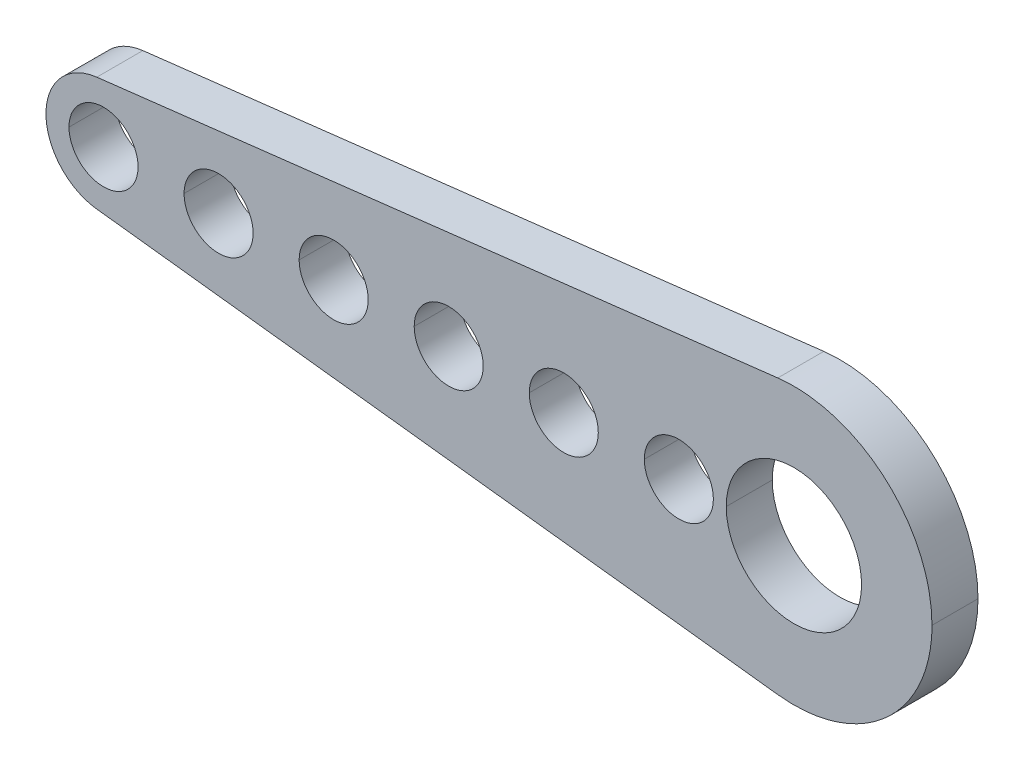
ISO-10303-21;
HEADER;
FILE_DESCRIPTION(('STEP AP214'),'2;1');
FILE_NAME('part.step','',(''),(''),'','','');
FILE_SCHEMA(('AUTOMOTIVE_DESIGN { 1 0 10303 214 1 1 1 1 }'));
ENDSEC;
DATA;
#1=APPLICATION_CONTEXT('core data for automotive mechanical design processes');
#2=APPLICATION_PROTOCOL_DEFINITION('international standard','automotive_design',2000,#1);
#3=PRODUCT_CONTEXT('',#1,'mechanical');
#4=PRODUCT('Part','Part','',(#3));
#5=PRODUCT_RELATED_PRODUCT_CATEGORY('part','',(#4));
#6=PRODUCT_DEFINITION_FORMATION('','',#4);
#7=PRODUCT_DEFINITION_CONTEXT('part definition',#1,'design');
#8=PRODUCT_DEFINITION('design','',#6,#7);
#9=PRODUCT_DEFINITION_SHAPE('','',#8);
#10=(LENGTH_UNIT() NAMED_UNIT(*) SI_UNIT(.MILLI.,.METRE.));
#11=(NAMED_UNIT(*) PLANE_ANGLE_UNIT() SI_UNIT($,.RADIAN.));
#12=(NAMED_UNIT(*) SI_UNIT($,.STERADIAN.) SOLID_ANGLE_UNIT());
#13=UNCERTAINTY_MEASURE_WITH_UNIT(LENGTH_MEASURE(1.E-05),#10,'distance_accuracy_value','');
#14=(GEOMETRIC_REPRESENTATION_CONTEXT(3) GLOBAL_UNCERTAINTY_ASSIGNED_CONTEXT((#13)) GLOBAL_UNIT_ASSIGNED_CONTEXT((#10,
#11,#12)) REPRESENTATION_CONTEXT('',''));
#15=CARTESIAN_POINT('',(0.,0.,0.));
#16=DIRECTION('',(0.,0.,1.));
#17=DIRECTION('',(1.,0.,0.));
#18=AXIS2_PLACEMENT_3D('',#15,#16,#17);
#19=CARTESIAN_POINT('',(-4.46921935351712,-6.01374839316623,2.));
#20=DIRECTION('',(0.,0.,1.));
#21=DIRECTION('',(1.,0.,0.));
#22=AXIS2_PLACEMENT_3D('',#19,#20,#21);
#23=PLANE('',#22);
#24=CARTESIAN_POINT('',(27.5213652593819,-5.95902676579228,2.));
#25=CARTESIAN_POINT('',(27.9875457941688,-6.01374839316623,2.));
#26=CARTESIAN_POINT('',(28.4584197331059,-6.01366200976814,2.));
#27=CARTESIAN_POINT('',(29.3980855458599,-5.90277662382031,2.));
#28=CARTESIAN_POINT('',(29.8538284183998,-5.79225514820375,2.));
#29=CARTESIAN_POINT('',(30.6136306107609,-5.51326479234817,2.));
#30=CARTESIAN_POINT('',(30.9270544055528,-5.36639644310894,2.));
#31=CARTESIAN_POINT('',(31.6069806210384,-4.97302191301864,2.));
#32=CARTESIAN_POINT('',(31.9624855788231,-4.71142630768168,2.));
#33=CARTESIAN_POINT('',(33.0010973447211,-3.75484068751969,2.));
#34=CARTESIAN_POINT('',(33.5456260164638,-2.93203369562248,2.));
#35=CARTESIAN_POINT('',(34.1075094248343,-1.35737417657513,2.));
#36=CARTESIAN_POINT('',(34.2216055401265,-0.675608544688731,2.));
#37=CARTESIAN_POINT('',(34.2214754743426,2.13658795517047E-08,2.));
#38=B_SPLINE_CURVE_WITH_KNOTS('',3,(#24,#25,#26,#27,#28,#29,#30,#31,#32,#33,#34,#35,#36,#37),
.UNSPECIFIED.,.F.,.F.,(4,2,2,2,2,2,4),(0.,0.135206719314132,0.272542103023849,0.374811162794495,
0.505077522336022,0.792809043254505,1.),.UNSPECIFIED.);
#39=CARTESIAN_POINT('',(27.5213652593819,-5.95902676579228,2.));
#40=VERTEX_POINT('',#39);
#41=CARTESIAN_POINT('',(34.2214754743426,2.13658878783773E-08,2.));
#42=VERTEX_POINT('',#41);
#43=EDGE_CURVE('E11',#40,#42,#38,.T.);
#44=ORIENTED_EDGE('',*,*,#43,.T.);
#45=CARTESIAN_POINT('',(34.2214754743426,2.13658795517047E-08,2.));
#46=CARTESIAN_POINT('',(34.2212151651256,1.62354944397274,2.));
#47=CARTESIAN_POINT('',(33.5613147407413,3.21154273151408,2.));
#48=CARTESIAN_POINT('',(31.9166063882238,4.76232973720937,2.));
#49=CARTESIAN_POINT('',(31.4374694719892,5.10010105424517,2.));
#50=CARTESIAN_POINT('',(30.556651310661,5.54053892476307,2.));
#51=CARTESIAN_POINT('',(30.1924402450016,5.68033011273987,2.));
#52=CARTESIAN_POINT('',(29.3859744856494,5.90287682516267,2.));
#53=CARTESIAN_POINT('',(28.9427549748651,5.97326367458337,2.));
#54=CARTESIAN_POINT('',(28.1705592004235,6.00859958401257,2.));
#55=CARTESIAN_POINT('',(27.8447063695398,5.99698148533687,2.));
#56=CARTESIAN_POINT('',(27.5213652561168,5.95902676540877,2.));
#57=B_SPLINE_CURVE_WITH_KNOTS('',3,(#45,#46,#47,#48,#49,#50,#51,#52,#53,#54,#55,#56),
.UNSPECIFIED.,.F.,.F.,(4,2,2,2,2,4),(0.,0.496258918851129,0.66694679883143,0.77847825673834,
0.906698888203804,1.),.UNSPECIFIED.);
#58=CARTESIAN_POINT('',(27.5213652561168,5.95902676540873,2.));
#59=VERTEX_POINT('',#58);
#60=EDGE_CURVE('E24',#42,#59,#57,.T.);
#61=ORIENTED_EDGE('',*,*,#60,.T.);
#62=CARTESIAN_POINT('',(27.5213652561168,5.95902676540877,2.));
#63=CARTESIAN_POINT('',(17.6574566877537,4.80034291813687,2.));
#64=CARTESIAN_POINT('',(7.79354811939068,3.64165907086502,2.));
#65=CARTESIAN_POINT('',(-2.07028754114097,2.48291133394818,2.));
#66=CARTESIAN_POINT('',(-2.07029342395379,2.48291064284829,2.));
#67=CARTESIAN_POINT('',(-2.07029930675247,2.48290995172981,2.));
#68=B_SPLINE_CURVE_WITH_KNOTS('',3,(#62,#63,#64,#65,#66,#67),.UNSPECIFIED.,.F.,.F.,(4,2,4),(0.,
0.999999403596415,1.),.UNSPECIFIED.);
#69=CARTESIAN_POINT('',(-2.07029930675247,2.48290995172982,2.));
#70=VERTEX_POINT('',#69);
#71=EDGE_CURVE('E433',#59,#70,#68,.T.);
#72=ORIENTED_EDGE('',*,*,#71,.T.);
#73=CARTESIAN_POINT('',(-2.07029930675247,2.48290995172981,2.));
#74=CARTESIAN_POINT('',(-2.3269335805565,2.45275307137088,2.));
#75=CARTESIAN_POINT('',(-2.55667440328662,2.38722255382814,2.));
#76=CARTESIAN_POINT('',(-3.0544967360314,2.17223776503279,2.));
#77=CARTESIAN_POINT('',(-3.29190454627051,2.00948053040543,2.));
#78=CARTESIAN_POINT('',(-4.22007546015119,1.133096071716,2.));
#79=CARTESIAN_POINT('',(-4.46921935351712,0.0828680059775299,2.));
#80=CARTESIAN_POINT('',(-4.0222755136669,-1.14533912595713,2.));
#81=CARTESIAN_POINT('',(-3.86348658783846,-1.41381135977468,2.));
#82=CARTESIAN_POINT('',(-3.52458046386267,-1.80103740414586,2.));
#83=CARTESIAN_POINT('',(-3.37081645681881,-1.93833629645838,2.));
#84=CARTESIAN_POINT('',(-3.01422242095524,-2.18534453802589,2.));
#85=CARTESIAN_POINT('',(-2.80629366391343,-2.29243787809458,2.));
#86=CARTESIAN_POINT('',(-2.40891945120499,-2.42534393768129,2.));
#87=CARTESIAN_POINT('',(-2.24090518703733,-2.46286998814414,2.));
#88=CARTESIAN_POINT('',(-2.07029999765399,-2.48291583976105,2.));
#89=B_SPLINE_CURVE_WITH_KNOTS('',3,(#73,#74,#75,#76,#77,#78,#79,#80,#81,#82,#83,#84,#85,#86,#87,
#88),.UNSPECIFIED.,.F.,.F.,(4,2,2,2,2,2,2,4),(0.,0.087594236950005,0.204501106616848,
0.622371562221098,0.751872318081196,0.837869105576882,0.93353580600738,1.),.UNSPECIFIED.);
#90=CARTESIAN_POINT('',(-2.07029999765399,-2.48291583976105,2.));
#91=VERTEX_POINT('',#90);
#92=EDGE_CURVE('E821',#70,#91,#89,.T.);
#93=ORIENTED_EDGE('',*,*,#92,.T.);
#94=CARTESIAN_POINT('',(-2.07029999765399,-2.48291583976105,2.));
#95=CARTESIAN_POINT('',(-2.0702960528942,-2.48291630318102,2.));
#96=CARTESIAN_POINT('',(-2.07029210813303,-2.48291676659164,2.));
#97=CARTESIAN_POINT('',(7.79356109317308,-3.64164865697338,2.));
#98=CARTESIAN_POINT('',(17.6574631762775,-4.80033771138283,2.));
#99=CARTESIAN_POINT('',(27.5213652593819,-5.95902676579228,2.));
#100=B_SPLINE_CURVE_WITH_KNOTS('',3,(#94,#95,#96,#97,#98,#99),.UNSPECIFIED.,.F.,.F.,(4,2,4),(0.,
3.99921053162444E-07,1.),.UNSPECIFIED.);
#101=EDGE_CURVE('E781',#91,#40,#100,.T.);
#102=ORIENTED_EDGE('',*,*,#101,.T.);
#103=EDGE_LOOP('',(#44,#61,#72,#93,#102));
#104=FACE_BOUND('',#103,.T.);
#105=CARTESIAN_POINT('',(28.221365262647,0.,2.));
#106=DIRECTION('',(0.,0.,1.));
#107=DIRECTION('',(-1.,0.,0.));
#108=AXIS2_PLACEMENT_3D('',#105,#106,#107);
#109=CIRCLE('',#108,2.94);
#110=CARTESIAN_POINT('',(25.281365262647,0.,2.));
#111=VERTEX_POINT('',#110);
#112=CARTESIAN_POINT('',(31.161365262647,0.,2.));
#113=VERTEX_POINT('',#112);
#114=EDGE_CURVE('E824',#111,#113,#109,.T.);
#115=ORIENTED_EDGE('',*,*,#114,.F.);
#116=CARTESIAN_POINT('',(28.221365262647,0.,2.));
#117=DIRECTION('',(0.,0.,1.));
#118=DIRECTION('',(1.,0.,0.));
#119=AXIS2_PLACEMENT_3D('',#116,#117,#118);
#120=CIRCLE('',#119,2.94);
#121=EDGE_CURVE('E827',#113,#111,#120,.T.);
#122=ORIENTED_EDGE('',*,*,#121,.F.);
#123=EDGE_LOOP('',(#115,#122));
#124=FACE_BOUND('',#123,.T.);
#125=CARTESIAN_POINT('',(18.221365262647,0.,2.));
#126=DIRECTION('',(0.,0.,1.));
#127=DIRECTION('',(-1.,0.,0.));
#128=AXIS2_PLACEMENT_3D('',#125,#126,#127);
#129=CIRCLE('',#128,1.5);
#130=CARTESIAN_POINT('',(16.721365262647,0.,2.));
#131=VERTEX_POINT('',#130);
#132=CARTESIAN_POINT('',(19.721365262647,0.,2.));
#133=VERTEX_POINT('',#132);
#134=EDGE_CURVE('E161',#131,#133,#129,.T.);
#135=ORIENTED_EDGE('',*,*,#134,.F.);
#136=CARTESIAN_POINT('',(18.221365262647,0.,2.));
#137=DIRECTION('',(0.,0.,1.));
#138=DIRECTION('',(1.,0.,0.));
#139=AXIS2_PLACEMENT_3D('',#136,#137,#138);
#140=CIRCLE('',#139,1.5);
#141=EDGE_CURVE('E716',#133,#131,#140,.T.);
#142=ORIENTED_EDGE('',*,*,#141,.F.);
#143=EDGE_LOOP('',(#135,#142));
#144=FACE_BOUND('',#143,.T.);
#145=CARTESIAN_POINT('',(23.221365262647,0.,2.));
#146=DIRECTION('',(0.,0.,1.));
#147=DIRECTION('',(-1.,0.,0.));
#148=AXIS2_PLACEMENT_3D('',#145,#146,#147);
#149=CIRCLE('',#148,1.5);
#150=CARTESIAN_POINT('',(21.721365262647,0.,2.));
#151=VERTEX_POINT('',#150);
#152=CARTESIAN_POINT('',(24.721365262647,0.,2.));
#153=VERTEX_POINT('',#152);
#154=EDGE_CURVE('E699',#151,#153,#149,.T.);
#155=ORIENTED_EDGE('',*,*,#154,.F.);
#156=CARTESIAN_POINT('',(23.221365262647,0.,2.));
#157=DIRECTION('',(0.,0.,1.));
#158=DIRECTION('',(1.,0.,0.));
#159=AXIS2_PLACEMENT_3D('',#156,#157,#158);
#160=CIRCLE('',#159,1.5);
#161=EDGE_CURVE('E550',#153,#151,#160,.T.);
#162=ORIENTED_EDGE('',*,*,#161,.F.);
#163=EDGE_LOOP('',(#155,#162));
#164=FACE_BOUND('',#163,.T.);
#165=CARTESIAN_POINT('',(13.221365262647,0.,2.));
#166=DIRECTION('',(0.,0.,1.));
#167=DIRECTION('',(-1.,0.,0.));
#168=AXIS2_PLACEMENT_3D('',#165,#166,#167);
#169=CIRCLE('',#168,1.5);
#170=CARTESIAN_POINT('',(11.721365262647,0.,2.));
#171=VERTEX_POINT('',#170);
#172=CARTESIAN_POINT('',(14.721365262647,0.,2.));
#173=VERTEX_POINT('',#172);
#174=EDGE_CURVE('E236',#171,#173,#169,.T.);
#175=ORIENTED_EDGE('',*,*,#174,.F.);
#176=CARTESIAN_POINT('',(13.221365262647,0.,2.));
#177=DIRECTION('',(0.,0.,1.));
#178=DIRECTION('',(1.,0.,0.));
#179=AXIS2_PLACEMENT_3D('',#176,#177,#178);
#180=CIRCLE('',#179,1.5);
#181=EDGE_CURVE('E259',#173,#171,#180,.T.);
#182=ORIENTED_EDGE('',*,*,#181,.F.);
#183=EDGE_LOOP('',(#175,#182));
#184=FACE_BOUND('',#183,.T.);
#185=CARTESIAN_POINT('',(-1.77863473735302,0.,2.));
#186=DIRECTION('',(0.,0.,1.));
#187=DIRECTION('',(-1.,0.,0.));
#188=AXIS2_PLACEMENT_3D('',#185,#186,#187);
#189=CIRCLE('',#188,1.5);
#190=CARTESIAN_POINT('',(-3.27863473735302,0.,2.));
#191=VERTEX_POINT('',#190);
#192=CARTESIAN_POINT('',(-0.278634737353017,0.,2.));
#193=VERTEX_POINT('',#192);
#194=EDGE_CURVE('E717',#191,#193,#189,.T.);
#195=ORIENTED_EDGE('',*,*,#194,.F.);
#196=CARTESIAN_POINT('',(-1.77863473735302,0.,2.));
#197=DIRECTION('',(0.,0.,1.));
#198=DIRECTION('',(1.,0.,0.));
#199=AXIS2_PLACEMENT_3D('',#196,#197,#198);
#200=CIRCLE('',#199,1.5);
#201=EDGE_CURVE('E719',#193,#191,#200,.T.);
#202=ORIENTED_EDGE('',*,*,#201,.F.);
#203=EDGE_LOOP('',(#195,#202));
#204=FACE_BOUND('',#203,.T.);
#205=CARTESIAN_POINT('',(3.22136526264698,0.,2.));
#206=DIRECTION('',(0.,0.,1.));
#207=DIRECTION('',(-1.,0.,0.));
#208=AXIS2_PLACEMENT_3D('',#205,#206,#207);
#209=CIRCLE('',#208,1.5);
#210=CARTESIAN_POINT('',(1.72136526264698,0.,2.));
#211=VERTEX_POINT('',#210);
#212=CARTESIAN_POINT('',(4.72136526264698,0.,2.));
#213=VERTEX_POINT('',#212);
#214=EDGE_CURVE('E617',#211,#213,#209,.T.);
#215=ORIENTED_EDGE('',*,*,#214,.F.);
#216=CARTESIAN_POINT('',(3.22136526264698,0.,2.));
#217=DIRECTION('',(0.,0.,1.));
#218=DIRECTION('',(1.,0.,0.));
#219=AXIS2_PLACEMENT_3D('',#216,#217,#218);
#220=CIRCLE('',#219,1.5);
#221=EDGE_CURVE('E636',#213,#211,#220,.T.);
#222=ORIENTED_EDGE('',*,*,#221,.F.);
#223=EDGE_LOOP('',(#215,#222));
#224=FACE_BOUND('',#223,.T.);
#225=CARTESIAN_POINT('',(8.22136526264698,0.,2.));
#226=DIRECTION('',(0.,0.,1.));
#227=DIRECTION('',(-1.,0.,0.));
#228=AXIS2_PLACEMENT_3D('',#225,#226,#227);
#229=CIRCLE('',#228,1.5);
#230=CARTESIAN_POINT('',(6.72136526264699,0.,2.));
#231=VERTEX_POINT('',#230);
#232=CARTESIAN_POINT('',(9.72136526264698,0.,2.));
#233=VERTEX_POINT('',#232);
#234=EDGE_CURVE('E723',#231,#233,#229,.T.);
#235=ORIENTED_EDGE('',*,*,#234,.F.);
#236=CARTESIAN_POINT('',(8.22136526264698,0.,2.));
#237=DIRECTION('',(0.,0.,1.));
#238=DIRECTION('',(1.,0.,0.));
#239=AXIS2_PLACEMENT_3D('',#236,#237,#238);
#240=CIRCLE('',#239,1.5);
#241=EDGE_CURVE('E725',#233,#231,#240,.T.);
#242=ORIENTED_EDGE('',*,*,#241,.F.);
#243=EDGE_LOOP('',(#235,#242));
#244=FACE_BOUND('',#243,.T.);
#245=ADVANCED_FACE('F16',(#104,#124,#144,#164,#184,#204,#224,#244),#23,.T.);
#246=CARTESIAN_POINT('',(8.22136526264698,0.,2.));
#247=DIRECTION('',(0.,0.,-1.));
#248=DIRECTION('',(0.,-1.,0.));
#249=AXIS2_PLACEMENT_3D('',#246,#247,#248);
#250=CYLINDRICAL_SURFACE('',#249,1.5);
#251=ORIENTED_EDGE('',*,*,#241,.T.);
#252=CARTESIAN_POINT('',(6.72136526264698,0.,2.));
#253=DIRECTION('',(0.,0.,-1.));
#254=VECTOR('',#253,1.);
#255=LINE('',#252,#254);
#256=CARTESIAN_POINT('',(6.72136526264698,0.,0.));
#257=VERTEX_POINT('',#256);
#258=EDGE_CURVE('E731',#231,#257,#255,.T.);
#259=ORIENTED_EDGE('',*,*,#258,.T.);
#260=CARTESIAN_POINT('',(9.72136526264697,0.,0.));
#261=CARTESIAN_POINT('',(9.72125424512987,0.2732497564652,0.));
#262=CARTESIAN_POINT('',(9.64691567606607,0.540908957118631,0.));
#263=CARTESIAN_POINT('',(9.42691293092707,0.90545218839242,0.));
#264=CARTESIAN_POINT('',(9.32864629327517,1.0232538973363,0.));
#265=CARTESIAN_POINT('',(9.09107382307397,1.23311381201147,0.));
#266=CARTESIAN_POINT('',(8.94818428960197,1.32508314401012,0.));
#267=CARTESIAN_POINT('',(8.66624605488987,1.43748704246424,0.));
#268=CARTESIAN_POINT('',(8.54963354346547,1.46897668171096,0.));
#269=CARTESIAN_POINT('',(8.31738859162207,1.50095289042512,0.));
#270=CARTESIAN_POINT('',(8.20715344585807,1.5039434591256,0.));
#271=CARTESIAN_POINT('',(7.92798663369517,1.48088843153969,0.));
#272=CARTESIAN_POINT('',(7.77787628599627,1.44087189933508,0.));
#273=CARTESIAN_POINT('',(7.44941144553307,1.30250182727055,0.));
#274=CARTESIAN_POINT('',(7.29694924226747,1.19485291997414,0.));
#275=CARTESIAN_POINT('',(6.87914333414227,0.783351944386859,0.));
#276=CARTESIAN_POINT('',(6.72152726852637,0.39874848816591,0.));
#277=CARTESIAN_POINT('',(6.72136526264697,0.,0.));
#278=B_SPLINE_CURVE_WITH_KNOTS('',3,(#260,#261,#262,#263,#264,#265,#266,#267,#268,#269,#270,
#271,#272,#273,#274,#275,#276,#277),.UNSPECIFIED.,.F.,.F.,(4,2,2,2,2,2,2,2,4),(0.,
0.172881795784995,0.26935340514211,0.373407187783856,0.440456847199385,0.499546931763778,
0.59116495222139,0.71654709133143,1.),.UNSPECIFIED.);
#279=CARTESIAN_POINT('',(9.72136526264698,0.,0.));
#280=VERTEX_POINT('',#279);
#281=EDGE_CURVE('E735',#280,#257,#278,.T.);
#282=ORIENTED_EDGE('',*,*,#281,.F.);
#283=CARTESIAN_POINT('',(9.72136526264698,0.,0.));
#284=DIRECTION('',(0.,0.,1.));
#285=VECTOR('',#284,1.);
#286=LINE('',#283,#285);
#287=EDGE_CURVE('E739',#280,#233,#286,.T.);
#288=ORIENTED_EDGE('',*,*,#287,.T.);
#289=EDGE_LOOP('',(#251,#259,#282,#288));
#290=FACE_BOUND('',#289,.T.);
#291=ADVANCED_FACE('F953',(#290),#250,.F.);
#292=CARTESIAN_POINT('',(8.22136526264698,0.,2.));
#293=DIRECTION('',(0.,0.,-1.));
#294=DIRECTION('',(0.,1.,0.));
#295=AXIS2_PLACEMENT_3D('',#292,#293,#294);
#296=CYLINDRICAL_SURFACE('',#295,1.5);
#297=CARTESIAN_POINT('',(6.72136526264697,0.,0.));
#298=CARTESIAN_POINT('',(6.72147628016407,-0.27324975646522,0.));
#299=CARTESIAN_POINT('',(6.79581484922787,-0.54090895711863,0.));
#300=CARTESIAN_POINT('',(7.01581759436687,-0.90545218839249,0.));
#301=CARTESIAN_POINT('',(7.11408423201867,-1.02325389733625,0.));
#302=CARTESIAN_POINT('',(7.35165670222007,-1.23311381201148,0.));
#303=CARTESIAN_POINT('',(7.49454623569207,-1.32508314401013,0.));
#304=CARTESIAN_POINT('',(7.77648447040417,-1.43748704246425,0.));
#305=CARTESIAN_POINT('',(7.89309698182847,-1.46897668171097,0.));
#306=CARTESIAN_POINT('',(8.12534193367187,-1.50095289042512,0.));
#307=CARTESIAN_POINT('',(8.23557707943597,-1.50394345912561,0.));
#308=CARTESIAN_POINT('',(8.51474389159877,-1.4808884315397,0.));
#309=CARTESIAN_POINT('',(8.66485423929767,-1.44087189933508,0.));
#310=CARTESIAN_POINT('',(8.99331907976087,-1.30250182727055,0.));
#311=CARTESIAN_POINT('',(9.14578128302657,-1.19485291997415,0.));
#312=CARTESIAN_POINT('',(9.56358719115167,-0.783351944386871,0.));
#313=CARTESIAN_POINT('',(9.72120325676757,-0.39874848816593,0.));
#314=CARTESIAN_POINT('',(9.72136526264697,0.,0.));
#315=B_SPLINE_CURVE_WITH_KNOTS('',3,(#297,#298,#299,#300,#301,#302,#303,#304,#305,#306,#307,
#308,#309,#310,#311,#312,#313,#314),.UNSPECIFIED.,.F.,.F.,(4,2,2,2,2,2,2,2,4),(0.,
0.172881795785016,0.269353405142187,0.373407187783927,0.440456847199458,0.499546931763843,
0.591164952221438,0.716547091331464,1.),.UNSPECIFIED.);
#316=EDGE_CURVE('E741',#257,#280,#315,.T.);
#317=ORIENTED_EDGE('',*,*,#316,.F.);
#318=ORIENTED_EDGE('',*,*,#258,.F.);
#319=ORIENTED_EDGE('',*,*,#234,.T.);
#320=ORIENTED_EDGE('',*,*,#287,.F.);
#321=EDGE_LOOP('',(#317,#318,#319,#320));
#322=FACE_BOUND('',#321,.T.);
#323=ADVANCED_FACE('F323',(#322),#296,.F.);
#324=CARTESIAN_POINT('',(-4.46921935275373,-6.00859958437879,0.));
#325=DIRECTION('',(0.,0.,-1.));
#326=DIRECTION('',(0.,1.,0.));
#327=AXIS2_PLACEMENT_3D('',#324,#325,#326);
#328=PLANE('',#327);
#329=CARTESIAN_POINT('',(-1.77863473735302,0.,0.));
#330=DIRECTION('',(0.,0.,1.));
#331=DIRECTION('',(-0.116666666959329,0.993171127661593,0.));
#332=AXIS2_PLACEMENT_3D('',#329,#330,#331);
#333=CIRCLE('',#332,2.5);
#334=CARTESIAN_POINT('',(-2.07029999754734,2.48291583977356,0.));
#335=VERTEX_POINT('',#334);
#336=CARTESIAN_POINT('',(-2.07029930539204,-2.48290995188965,0.));
#337=VERTEX_POINT('',#336);
#338=EDGE_CURVE('E424',#335,#337,#333,.T.);
#339=ORIENTED_EDGE('',*,*,#338,.F.);
#340=CARTESIAN_POINT('',(27.5213652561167,5.95902676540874,0.));
#341=DIRECTION('',(-0.993171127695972,-0.116666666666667,0.));
#342=VECTOR('',#341,1.);
#343=LINE('',#340,#342);
#344=CARTESIAN_POINT('',(27.5213652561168,5.95902676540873,0.));
#345=VERTEX_POINT('',#344);
#346=EDGE_CURVE('E420',#345,#335,#343,.T.);
#347=ORIENTED_EDGE('',*,*,#346,.F.);
#348=CARTESIAN_POINT('',(28.221365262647,0.,0.));
#349=DIRECTION('',(0.,0.,1.));
#350=DIRECTION('',(1.,-3.56092000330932E-09,0.));
#351=AXIS2_PLACEMENT_3D('',#348,#349,#350);
#352=CIRCLE('',#351,6.00000000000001);
#353=CARTESIAN_POINT('',(34.2214754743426,-2.13658844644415E-08,0.));
#354=VERTEX_POINT('',#353);
#355=EDGE_CURVE('E410',#354,#345,#352,.T.);
#356=ORIENTED_EDGE('',*,*,#355,.F.);
#357=CARTESIAN_POINT('',(28.221365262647,0.,0.));
#358=DIRECTION('',(0.,0.,1.));
#359=DIRECTION('',(-0.11666666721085,-0.993171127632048,0.));
#360=AXIS2_PLACEMENT_3D('',#357,#358,#359);
#361=CIRCLE('',#360,6.);
#362=CARTESIAN_POINT('',(27.5213652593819,-5.95902676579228,0.));
#363=VERTEX_POINT('',#362);
#364=EDGE_CURVE('E446',#363,#354,#361,.T.);
#365=ORIENTED_EDGE('',*,*,#364,.F.);
#366=CARTESIAN_POINT('',(-2.07030140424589,-2.48292781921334,0.));
#367=DIRECTION('',(0.993171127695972,-0.116666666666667,0.));
#368=VECTOR('',#367,1.);
#369=LINE('',#366,#368);
#370=EDGE_CURVE('E789',#337,#363,#369,.T.);
#371=ORIENTED_EDGE('',*,*,#370,.F.);
#372=EDGE_LOOP('',(#339,#347,#356,#365,#371));
#373=FACE_BOUND('',#372,.T.);
#374=CARTESIAN_POINT('',(31.161365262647,0.,0.));
#375=CARTESIAN_POINT('',(31.1611476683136,0.53556952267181,0.));
#376=CARTESIAN_POINT('',(31.0154440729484,1.06018155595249,0.));
#377=CARTESIAN_POINT('',(30.584238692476,1.77468628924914,0.));
#378=CARTESIAN_POINT('',(30.3916360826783,2.00557763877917,0.));
#379=CARTESIAN_POINT('',(30.0211796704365,2.33282073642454,0.));
#380=CARTESIAN_POINT('',(29.8622145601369,2.44727981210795,0.));
#381=CARTESIAN_POINT('',(29.4911881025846,2.66191718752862,0.));
#382=CARTESIAN_POINT('',(29.2738698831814,2.75605701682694,0.));
#383=CARTESIAN_POINT('',(28.7736255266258,2.90098699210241,0.));
#384=CARTESIAN_POINT('',(28.4982835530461,2.94,0.));
#385=CARTESIAN_POINT('',(27.9444469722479,2.93999999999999,0.));
#386=CARTESIAN_POINT('',(27.6691049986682,2.90098699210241,0.));
#387=CARTESIAN_POINT('',(27.1227200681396,2.74268924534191,0.));
#388=CARTESIAN_POINT('',(26.874941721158,2.62713603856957,0.));
#389=CARTESIAN_POINT('',(26.3004269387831,2.26363088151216,0.));
#390=CARTESIAN_POINT('',(26.0162501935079,1.98294329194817,0.));
#391=CARTESIAN_POINT('',(25.4605537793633,1.17227659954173,0.));
#392=CARTESIAN_POINT('',(25.2816064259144,0.59358023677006,0.));
#393=CARTESIAN_POINT('',(25.281365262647,0.,0.));
#394=B_SPLINE_CURVE_WITH_KNOTS('',3,(#374,#375,#376,#377,#378,#379,#380,#381,#382,#383,#384,
#385,#386,#387,#388,#389,#390,#391,#392,#393),.UNSPECIFIED.,.F.,.F.,(4,2,2,2,2,2,2,2,2,4),(0.,
0.169172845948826,0.263574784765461,0.325284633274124,0.398958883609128,0.482558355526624,
0.566157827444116,0.654338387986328,0.791216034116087,1.),.UNSPECIFIED.);
#395=CARTESIAN_POINT('',(31.161365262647,0.,0.));
#396=VERTEX_POINT('',#395);
#397=CARTESIAN_POINT('',(25.281365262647,0.,0.));
#398=VERTEX_POINT('',#397);
#399=EDGE_CURVE('E876',#396,#398,#394,.T.);
#400=ORIENTED_EDGE('',*,*,#399,.T.);
#401=CARTESIAN_POINT('',(25.281365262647,0.,0.));
#402=CARTESIAN_POINT('',(25.2815828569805,-0.53556952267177,0.));
#403=CARTESIAN_POINT('',(25.4272864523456,-1.06018155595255,0.));
#404=CARTESIAN_POINT('',(25.8584918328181,-1.77468628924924,0.));
#405=CARTESIAN_POINT('',(26.0510944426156,-2.00557763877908,0.));
#406=CARTESIAN_POINT('',(26.4215508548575,-2.33282073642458,0.));
#407=CARTESIAN_POINT('',(26.5805159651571,-2.44727981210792,0.));
#408=CARTESIAN_POINT('',(26.9515424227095,-2.66191718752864,0.));
#409=CARTESIAN_POINT('',(27.1688606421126,-2.75605701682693,0.));
#410=CARTESIAN_POINT('',(27.6691049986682,-2.90098699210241,0.));
#411=CARTESIAN_POINT('',(27.9444469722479,-2.94,0.));
#412=CARTESIAN_POINT('',(28.4982835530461,-2.94,0.));
#413=CARTESIAN_POINT('',(28.7736255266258,-2.90098699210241,0.));
#414=CARTESIAN_POINT('',(29.3200104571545,-2.74268924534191,0.));
#415=CARTESIAN_POINT('',(29.567788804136,-2.6271360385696,0.));
#416=CARTESIAN_POINT('',(30.1423035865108,-2.2636308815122,0.));
#417=CARTESIAN_POINT('',(30.4264803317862,-1.98294329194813,0.));
#418=CARTESIAN_POINT('',(30.9821767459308,-1.17227659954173,0.));
#419=CARTESIAN_POINT('',(31.1611240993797,-0.593580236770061,0.));
#420=CARTESIAN_POINT('',(31.161365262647,0.,0.));
#421=B_SPLINE_CURVE_WITH_KNOTS('',3,(#401,#402,#403,#404,#405,#406,#407,#408,#409,#410,#411,
#412,#413,#414,#415,#416,#417,#418,#419,#420),.UNSPECIFIED.,.F.,.F.,(4,2,2,2,2,2,2,2,2,4),(0.,
0.169172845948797,0.263574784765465,0.325284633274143,0.39895888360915,0.482558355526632,
0.566157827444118,0.654338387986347,0.791216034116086,1.),.UNSPECIFIED.);
#422=EDGE_CURVE('E875',#398,#396,#421,.T.);
#423=ORIENTED_EDGE('',*,*,#422,.T.);
#424=EDGE_LOOP('',(#400,#423));
#425=FACE_BOUND('',#424,.T.);
#426=CARTESIAN_POINT('',(-0.27863473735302,0.,0.));
#427=CARTESIAN_POINT('',(-0.27874575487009,0.2732497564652,0.));
#428=CARTESIAN_POINT('',(-0.35308432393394,0.540908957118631,0.));
#429=CARTESIAN_POINT('',(-0.573087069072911,0.90545218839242,0.));
#430=CARTESIAN_POINT('',(-0.671353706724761,1.02325389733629,0.));
#431=CARTESIAN_POINT('',(-0.908926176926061,1.23311381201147,0.));
#432=CARTESIAN_POINT('',(-1.05181571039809,1.32508314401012,0.));
#433=CARTESIAN_POINT('',(-1.33375394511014,1.43748704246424,0.));
#434=CARTESIAN_POINT('',(-1.45036645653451,1.46897668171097,0.));
#435=CARTESIAN_POINT('',(-1.68261140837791,1.50095289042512,0.));
#436=CARTESIAN_POINT('',(-1.79284655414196,1.5039434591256,0.));
#437=CARTESIAN_POINT('',(-2.07201336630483,1.48088843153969,0.));
#438=CARTESIAN_POINT('',(-2.22212371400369,1.44087189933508,0.));
#439=CARTESIAN_POINT('',(-2.55058855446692,1.30250182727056,0.));
#440=CARTESIAN_POINT('',(-2.70305075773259,1.19485291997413,0.));
#441=CARTESIAN_POINT('',(-3.12085666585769,0.783351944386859,0.));
#442=CARTESIAN_POINT('',(-3.27847273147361,0.39874848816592,0.));
#443=CARTESIAN_POINT('',(-3.27863473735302,0.,0.));
#444=B_SPLINE_CURVE_WITH_KNOTS('',3,(#426,#427,#428,#429,#430,#431,#432,#433,#434,#435,#436,
#437,#438,#439,#440,#441,#442,#443),.UNSPECIFIED.,.F.,.F.,(4,2,2,2,2,2,2,2,4),(0.,
0.172881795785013,0.269353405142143,0.373407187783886,0.440456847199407,0.499546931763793,
0.591164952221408,0.716547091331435,1.),.UNSPECIFIED.);
#445=CARTESIAN_POINT('',(-0.278634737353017,0.,0.));
#446=VERTEX_POINT('',#445);
#447=CARTESIAN_POINT('',(-3.27863473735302,0.,0.));
#448=VERTEX_POINT('',#447);
#449=EDGE_CURVE('E678',#446,#448,#444,.T.);
#450=ORIENTED_EDGE('',*,*,#449,.T.);
#451=CARTESIAN_POINT('',(-3.27863473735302,0.,0.));
#452=CARTESIAN_POINT('',(-3.27852371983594,-0.2732497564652,0.));
#453=CARTESIAN_POINT('',(-3.20418515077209,-0.54090895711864,0.));
#454=CARTESIAN_POINT('',(-2.98418240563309,-0.90545218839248,0.));
#455=CARTESIAN_POINT('',(-2.88591576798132,-1.02325389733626,0.));
#456=CARTESIAN_POINT('',(-2.64834329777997,-1.23311381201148,0.));
#457=CARTESIAN_POINT('',(-2.50545376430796,-1.32508314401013,0.));
#458=CARTESIAN_POINT('',(-2.22351552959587,-1.43748704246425,0.));
#459=CARTESIAN_POINT('',(-2.10690301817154,-1.46897668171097,0.));
#460=CARTESIAN_POINT('',(-1.87465806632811,-1.50095289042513,0.));
#461=CARTESIAN_POINT('',(-1.76442292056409,-1.50394345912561,0.));
#462=CARTESIAN_POINT('',(-1.48525610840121,-1.4808884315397,0.));
#463=CARTESIAN_POINT('',(-1.33514576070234,-1.44087189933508,0.));
#464=CARTESIAN_POINT('',(-1.0066809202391,-1.30250182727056,0.));
#465=CARTESIAN_POINT('',(-0.854218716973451,-1.19485291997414,0.));
#466=CARTESIAN_POINT('',(-0.43641280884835,-0.783351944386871,0.));
#467=CARTESIAN_POINT('',(-0.27879674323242,-0.39874848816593,0.));
#468=CARTESIAN_POINT('',(-0.27863473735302,0.,0.));
#469=B_SPLINE_CURVE_WITH_KNOTS('',3,(#451,#452,#453,#454,#455,#456,#457,#458,#459,#460,#461,
#462,#463,#464,#465,#466,#467,#468),.UNSPECIFIED.,.F.,.F.,(4,2,2,2,2,2,2,2,4),(0.,
0.172881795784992,0.269353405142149,0.373407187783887,0.440456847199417,0.499546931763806,
0.591164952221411,0.716547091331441,1.),.UNSPECIFIED.);
#470=EDGE_CURVE('E677',#448,#446,#469,.T.);
#471=ORIENTED_EDGE('',*,*,#470,.T.);
#472=EDGE_LOOP('',(#450,#471));
#473=FACE_BOUND('',#472,.T.);
#474=CARTESIAN_POINT('',(4.72136526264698,0.,0.));
#475=CARTESIAN_POINT('',(4.72125424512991,0.2732497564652,0.));
#476=CARTESIAN_POINT('',(4.64691567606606,0.540908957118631,0.));
#477=CARTESIAN_POINT('',(4.4269129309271,0.905452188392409,0.));
#478=CARTESIAN_POINT('',(4.32864629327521,1.02325389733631,0.));
#479=CARTESIAN_POINT('',(4.09107382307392,1.23311381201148,0.));
#480=CARTESIAN_POINT('',(3.94818428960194,1.32508314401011,0.));
#481=CARTESIAN_POINT('',(3.66624605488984,1.43748704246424,0.));
#482=CARTESIAN_POINT('',(3.5496335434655,1.46897668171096,0.));
#483=CARTESIAN_POINT('',(3.31738859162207,1.50095289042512,0.));
#484=CARTESIAN_POINT('',(3.20715344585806,1.5039434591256,0.));
#485=CARTESIAN_POINT('',(2.92798663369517,1.48088843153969,0.));
#486=CARTESIAN_POINT('',(2.77787628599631,1.44087189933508,0.));
#487=CARTESIAN_POINT('',(2.44941144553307,1.30250182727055,0.));
#488=CARTESIAN_POINT('',(2.29694924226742,1.19485291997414,0.));
#489=CARTESIAN_POINT('',(1.87914333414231,0.783351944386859,0.));
#490=CARTESIAN_POINT('',(1.72152726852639,0.39874848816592,0.));
#491=CARTESIAN_POINT('',(1.72136526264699,0.,0.));
#492=B_SPLINE_CURVE_WITH_KNOTS('',3,(#474,#475,#476,#477,#478,#479,#480,#481,#482,#483,#484,
#485,#486,#487,#488,#489,#490,#491),.UNSPECIFIED.,.F.,.F.,(4,2,2,2,2,2,2,2,4),(0.,
0.172881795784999,0.269353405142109,0.373407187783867,0.440456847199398,0.499546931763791,
0.591164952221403,0.716547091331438,1.),.UNSPECIFIED.);
#493=CARTESIAN_POINT('',(4.72136526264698,0.,0.));
#494=VERTEX_POINT('',#493);
#495=CARTESIAN_POINT('',(1.72136526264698,0.,0.));
#496=VERTEX_POINT('',#495);
#497=EDGE_CURVE('E668',#494,#496,#492,.T.);
#498=ORIENTED_EDGE('',*,*,#497,.T.);
#499=CARTESIAN_POINT('',(1.72136526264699,0.,0.));
#500=CARTESIAN_POINT('',(1.72147628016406,-0.2732497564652,0.));
#501=CARTESIAN_POINT('',(1.79581484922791,-0.54090895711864,0.));
#502=CARTESIAN_POINT('',(2.01581759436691,-0.90545218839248,0.));
#503=CARTESIAN_POINT('',(2.11408423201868,-1.02325389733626,0.));
#504=CARTESIAN_POINT('',(2.35165670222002,-1.23311381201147,0.));
#505=CARTESIAN_POINT('',(2.49454623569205,-1.32508314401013,0.));
#506=CARTESIAN_POINT('',(2.77648447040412,-1.43748704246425,0.));
#507=CARTESIAN_POINT('',(2.89309698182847,-1.46897668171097,0.));
#508=CARTESIAN_POINT('',(3.12534193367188,-1.50095289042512,0.));
#509=CARTESIAN_POINT('',(3.23557707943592,-1.50394345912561,0.));
#510=CARTESIAN_POINT('',(3.51474389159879,-1.4808884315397,0.));
#511=CARTESIAN_POINT('',(3.66485423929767,-1.44087189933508,0.));
#512=CARTESIAN_POINT('',(3.99331907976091,-1.30250182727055,0.));
#513=CARTESIAN_POINT('',(4.14578128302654,-1.19485291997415,0.));
#514=CARTESIAN_POINT('',(4.56358719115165,-0.783351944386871,0.));
#515=CARTESIAN_POINT('',(4.72120325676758,-0.39874848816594,0.));
#516=CARTESIAN_POINT('',(4.72136526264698,0.,0.));
#517=B_SPLINE_CURVE_WITH_KNOTS('',3,(#499,#500,#501,#502,#503,#504,#505,#506,#507,#508,#509,
#510,#511,#512,#513,#514,#515,#516),.UNSPECIFIED.,.F.,.F.,(4,2,2,2,2,2,2,2,4),(0.,
0.172881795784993,0.269353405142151,0.373407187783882,0.440456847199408,0.49954693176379,
0.591164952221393,0.716547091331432,1.),.UNSPECIFIED.);
#518=EDGE_CURVE('E597',#496,#494,#517,.T.);
#519=ORIENTED_EDGE('',*,*,#518,.T.);
#520=EDGE_LOOP('',(#498,#519));
#521=FACE_BOUND('',#520,.T.);
#522=CARTESIAN_POINT('',(24.721365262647,0.,0.));
#523=CARTESIAN_POINT('',(24.72125424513,0.27324975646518,0.));
#524=CARTESIAN_POINT('',(24.6469156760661,0.540908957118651,0.));
#525=CARTESIAN_POINT('',(24.4269129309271,0.90545218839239,0.));
#526=CARTESIAN_POINT('',(24.3286462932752,1.02325389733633,0.));
#527=CARTESIAN_POINT('',(24.0910738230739,1.2331138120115,0.));
#528=CARTESIAN_POINT('',(23.948184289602,1.32508314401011,0.));
#529=CARTESIAN_POINT('',(23.6662460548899,1.43748704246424,0.));
#530=CARTESIAN_POINT('',(23.5496335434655,1.46897668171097,0.));
#531=CARTESIAN_POINT('',(23.3173885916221,1.50095289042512,0.));
#532=CARTESIAN_POINT('',(23.2071534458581,1.5039434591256,0.));
#533=CARTESIAN_POINT('',(22.9279866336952,1.48088843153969,0.));
#534=CARTESIAN_POINT('',(22.7778762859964,1.44087189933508,0.));
#535=CARTESIAN_POINT('',(22.4494114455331,1.30250182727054,0.));
#536=CARTESIAN_POINT('',(22.2969492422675,1.19485291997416,0.));
#537=CARTESIAN_POINT('',(21.8791433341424,0.783351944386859,0.));
#538=CARTESIAN_POINT('',(21.7215272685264,0.39874848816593,0.));
#539=CARTESIAN_POINT('',(21.721365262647,0.,0.));
#540=B_SPLINE_CURVE_WITH_KNOTS('',3,(#522,#523,#524,#525,#526,#527,#528,#529,#530,#531,#532,
#533,#534,#535,#536,#537,#538,#539),.UNSPECIFIED.,.F.,.F.,(4,2,2,2,2,2,2,2,4),(0.,
0.172881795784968,0.269353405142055,0.373407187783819,0.440456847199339,0.499546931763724,
0.591164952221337,0.716547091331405,1.),.UNSPECIFIED.);
#541=CARTESIAN_POINT('',(24.721365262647,0.,0.));
#542=VERTEX_POINT('',#541);
#543=CARTESIAN_POINT('',(21.721365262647,0.,0.));
#544=VERTEX_POINT('',#543);
#545=EDGE_CURVE('E304',#542,#544,#540,.T.);
#546=ORIENTED_EDGE('',*,*,#545,.T.);
#547=CARTESIAN_POINT('',(21.721365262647,0.,0.));
#548=CARTESIAN_POINT('',(21.7214762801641,-0.27324975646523,0.));
#549=CARTESIAN_POINT('',(21.7958148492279,-0.54090895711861,0.));
#550=CARTESIAN_POINT('',(22.015817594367,-0.90545218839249,0.));
#551=CARTESIAN_POINT('',(22.1140842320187,-1.02325389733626,0.));
#552=CARTESIAN_POINT('',(22.3516567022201,-1.23311381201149,0.));
#553=CARTESIAN_POINT('',(22.4945462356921,-1.32508314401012,0.));
#554=CARTESIAN_POINT('',(22.7764844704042,-1.43748704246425,0.));
#555=CARTESIAN_POINT('',(22.8930969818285,-1.46897668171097,0.));
#556=CARTESIAN_POINT('',(23.1253419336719,-1.50095289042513,0.));
#557=CARTESIAN_POINT('',(23.235577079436,-1.50394345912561,0.));
#558=CARTESIAN_POINT('',(23.5147438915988,-1.4808884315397,0.));
#559=CARTESIAN_POINT('',(23.6648542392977,-1.44087189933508,0.));
#560=CARTESIAN_POINT('',(23.993319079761,-1.30250182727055,0.));
#561=CARTESIAN_POINT('',(24.1457812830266,-1.19485291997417,0.));
#562=CARTESIAN_POINT('',(24.5635871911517,-0.783351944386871,0.));
#563=CARTESIAN_POINT('',(24.7212032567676,-0.39874848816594,0.));
#564=CARTESIAN_POINT('',(24.721365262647,0.,0.));
#565=B_SPLINE_CURVE_WITH_KNOTS('',3,(#547,#548,#549,#550,#551,#552,#553,#554,#555,#556,#557,
#558,#559,#560,#561,#562,#563,#564),.UNSPECIFIED.,.F.,.F.,(4,2,2,2,2,2,2,2,4),(0.,
0.17288179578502,0.269353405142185,0.373407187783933,0.440456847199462,0.499546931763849,
0.591164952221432,0.71654709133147,1.),.UNSPECIFIED.);
#566=EDGE_CURVE('E303',#544,#542,#565,.T.);
#567=ORIENTED_EDGE('',*,*,#566,.T.);
#568=EDGE_LOOP('',(#546,#567));
#569=FACE_BOUND('',#568,.T.);
#570=CARTESIAN_POINT('',(14.721365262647,0.,0.));
#571=CARTESIAN_POINT('',(14.7212542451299,0.2732497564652,0.));
#572=CARTESIAN_POINT('',(14.6469156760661,0.540908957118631,0.));
#573=CARTESIAN_POINT('',(14.4269129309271,0.90545218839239,0.));
#574=CARTESIAN_POINT('',(14.3286462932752,1.02325389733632,0.));
#575=CARTESIAN_POINT('',(14.091073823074,1.23311381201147,0.));
#576=CARTESIAN_POINT('',(13.9481842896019,1.32508314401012,0.));
#577=CARTESIAN_POINT('',(13.6662460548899,1.43748704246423,0.));
#578=CARTESIAN_POINT('',(13.5496335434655,1.46897668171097,0.));
#579=CARTESIAN_POINT('',(13.3173885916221,1.50095289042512,0.));
#580=CARTESIAN_POINT('',(13.2071534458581,1.5039434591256,0.));
#581=CARTESIAN_POINT('',(12.9279866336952,1.48088843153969,0.));
#582=CARTESIAN_POINT('',(12.7778762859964,1.44087189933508,0.));
#583=CARTESIAN_POINT('',(12.4494114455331,1.30250182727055,0.));
#584=CARTESIAN_POINT('',(12.2969492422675,1.19485291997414,0.));
#585=CARTESIAN_POINT('',(11.8791433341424,0.78335194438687,0.));
#586=CARTESIAN_POINT('',(11.7215272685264,0.39874848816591,0.));
#587=CARTESIAN_POINT('',(11.721365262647,0.,0.));
#588=B_SPLINE_CURVE_WITH_KNOTS('',3,(#570,#571,#572,#573,#574,#575,#576,#577,#578,#579,#580,
#581,#582,#583,#584,#585,#586,#587),.UNSPECIFIED.,.F.,.F.,(4,2,2,2,2,2,2,2,4),(0.,
0.172881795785,0.269353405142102,0.373407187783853,0.440456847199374,0.499546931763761,
0.591164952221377,0.71654709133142,1.),.UNSPECIFIED.);
#589=CARTESIAN_POINT('',(14.721365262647,0.,0.));
#590=VERTEX_POINT('',#589);
#591=CARTESIAN_POINT('',(11.721365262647,0.,0.));
#592=VERTEX_POINT('',#591);
#593=EDGE_CURVE('E293',#590,#592,#588,.T.);
#594=ORIENTED_EDGE('',*,*,#593,.T.);
#595=CARTESIAN_POINT('',(11.721365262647,0.,0.));
#596=CARTESIAN_POINT('',(11.7214762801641,-0.27324975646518,0.));
#597=CARTESIAN_POINT('',(11.7958148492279,-0.54090895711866,0.));
#598=CARTESIAN_POINT('',(12.0158175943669,-0.90545218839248,0.));
#599=CARTESIAN_POINT('',(12.1140842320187,-1.02325389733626,0.));
#600=CARTESIAN_POINT('',(12.3516567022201,-1.23311381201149,0.));
#601=CARTESIAN_POINT('',(12.494546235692,-1.32508314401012,0.));
#602=CARTESIAN_POINT('',(12.7764844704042,-1.43748704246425,0.));
#603=CARTESIAN_POINT('',(12.8930969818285,-1.46897668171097,0.));
#604=CARTESIAN_POINT('',(13.1253419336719,-1.50095289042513,0.));
#605=CARTESIAN_POINT('',(13.2355770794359,-1.50394345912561,0.));
#606=CARTESIAN_POINT('',(13.5147438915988,-1.4808884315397,0.));
#607=CARTESIAN_POINT('',(13.6648542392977,-1.44087189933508,0.));
#608=CARTESIAN_POINT('',(13.9933190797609,-1.30250182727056,0.));
#609=CARTESIAN_POINT('',(14.1457812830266,-1.19485291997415,0.));
#610=CARTESIAN_POINT('',(14.5635871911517,-0.783351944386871,0.));
#611=CARTESIAN_POINT('',(14.7212032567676,-0.39874848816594,0.));
#612=CARTESIAN_POINT('',(14.721365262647,0.,0.));
#613=B_SPLINE_CURVE_WITH_KNOTS('',3,(#595,#596,#597,#598,#599,#600,#601,#602,#603,#604,#605,
#606,#607,#608,#609,#610,#611,#612),.UNSPECIFIED.,.F.,.F.,(4,2,2,2,2,2,2,2,4),(0.,
0.172881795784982,0.269353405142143,0.373407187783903,0.440456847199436,0.499546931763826,
0.591164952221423,0.716547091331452,1.),.UNSPECIFIED.);
#614=EDGE_CURVE('E172',#592,#590,#613,.T.);
#615=ORIENTED_EDGE('',*,*,#614,.T.);
#616=EDGE_LOOP('',(#594,#615));
#617=FACE_BOUND('',#616,.T.);
#618=ORIENTED_EDGE('',*,*,#281,.T.);
#619=ORIENTED_EDGE('',*,*,#316,.T.);
#620=EDGE_LOOP('',(#618,#619));
#621=FACE_BOUND('',#620,.T.);
#622=CARTESIAN_POINT('',(19.721365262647,0.,0.));
#623=CARTESIAN_POINT('',(19.7212542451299,0.27324975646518,0.));
#624=CARTESIAN_POINT('',(19.6469156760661,0.540908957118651,0.));
#625=CARTESIAN_POINT('',(19.4269129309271,0.90545218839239,0.));
#626=CARTESIAN_POINT('',(19.3286462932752,1.02325389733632,0.));
#627=CARTESIAN_POINT('',(19.091073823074,1.23311381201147,0.));
#628=CARTESIAN_POINT('',(18.9481842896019,1.32508314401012,0.));
#629=CARTESIAN_POINT('',(18.6662460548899,1.43748704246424,0.));
#630=CARTESIAN_POINT('',(18.5496335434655,1.46897668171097,0.));
#631=CARTESIAN_POINT('',(18.3173885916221,1.50095289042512,0.));
#632=CARTESIAN_POINT('',(18.2071534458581,1.5039434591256,0.));
#633=CARTESIAN_POINT('',(17.9279866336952,1.48088843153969,0.));
#634=CARTESIAN_POINT('',(17.7778762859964,1.44087189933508,0.));
#635=CARTESIAN_POINT('',(17.4494114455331,1.30250182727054,0.));
#636=CARTESIAN_POINT('',(17.2969492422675,1.19485291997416,0.));
#637=CARTESIAN_POINT('',(16.8791433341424,0.783351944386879,0.));
#638=CARTESIAN_POINT('',(16.7215272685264,0.39874848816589,0.));
#639=CARTESIAN_POINT('',(16.721365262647,0.,0.));
#640=B_SPLINE_CURVE_WITH_KNOTS('',3,(#622,#623,#624,#625,#626,#627,#628,#629,#630,#631,#632,
#633,#634,#635,#636,#637,#638,#639),.UNSPECIFIED.,.F.,.F.,(4,2,2,2,2,2,2,2,4),(0.,
0.172881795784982,0.269353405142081,0.373407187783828,0.44045684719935,0.499546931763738,
0.591164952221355,0.716547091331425,1.),.UNSPECIFIED.);
#641=CARTESIAN_POINT('',(19.721365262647,0.,0.));
#642=VERTEX_POINT('',#641);
#643=CARTESIAN_POINT('',(16.721365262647,0.,0.));
#644=VERTEX_POINT('',#643);
#645=EDGE_CURVE('E147',#642,#644,#640,.T.);
#646=ORIENTED_EDGE('',*,*,#645,.T.);
#647=CARTESIAN_POINT('',(16.721365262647,0.,0.));
#648=CARTESIAN_POINT('',(16.7214762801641,-0.27324975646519,0.));
#649=CARTESIAN_POINT('',(16.7958148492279,-0.54090895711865,0.));
#650=CARTESIAN_POINT('',(17.015817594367,-0.905452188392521,0.));
#651=CARTESIAN_POINT('',(17.1140842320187,-1.02325389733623,0.));
#652=CARTESIAN_POINT('',(17.3516567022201,-1.23311381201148,0.));
#653=CARTESIAN_POINT('',(17.4945462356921,-1.32508314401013,0.));
#654=CARTESIAN_POINT('',(17.7764844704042,-1.43748704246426,0.));
#655=CARTESIAN_POINT('',(17.8930969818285,-1.46897668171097,0.));
#656=CARTESIAN_POINT('',(18.1253419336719,-1.50095289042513,0.));
#657=CARTESIAN_POINT('',(18.235577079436,-1.50394345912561,0.));
#658=CARTESIAN_POINT('',(18.5147438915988,-1.4808884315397,0.));
#659=CARTESIAN_POINT('',(18.6648542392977,-1.44087189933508,0.));
#660=CARTESIAN_POINT('',(18.9933190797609,-1.30250182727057,0.));
#661=CARTESIAN_POINT('',(19.1457812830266,-1.19485291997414,0.));
#662=CARTESIAN_POINT('',(19.5635871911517,-0.783351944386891,0.));
#663=CARTESIAN_POINT('',(19.7212032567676,-0.3987484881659,0.));
#664=CARTESIAN_POINT('',(19.721365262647,0.,0.));
#665=B_SPLINE_CURVE_WITH_KNOTS('',3,(#647,#648,#649,#650,#651,#652,#653,#654,#655,#656,#657,
#658,#659,#660,#661,#662,#663,#664),.UNSPECIFIED.,.F.,.F.,(4,2,2,2,2,2,2,2,4),(0.,
0.172881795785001,0.269353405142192,0.373407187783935,0.440456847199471,0.499546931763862,
0.591164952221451,0.716547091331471,1.),.UNSPECIFIED.);
#666=EDGE_CURVE('E142',#644,#642,#665,.T.);
#667=ORIENTED_EDGE('',*,*,#666,.T.);
#668=EDGE_LOOP('',(#646,#667));
#669=FACE_BOUND('',#668,.T.);
#670=ADVANCED_FACE('F145',(#373,#425,#473,#521,#569,#617,#621,#669),#328,.T.);
#671=CARTESIAN_POINT('',(18.221365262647,0.,2.));
#672=DIRECTION('',(0.,0.,-1.));
#673=DIRECTION('',(0.,1.,0.));
#674=AXIS2_PLACEMENT_3D('',#671,#672,#673);
#675=CYLINDRICAL_SURFACE('',#674,1.5);
#676=ORIENTED_EDGE('',*,*,#666,.F.);
#677=CARTESIAN_POINT('',(16.721365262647,0.,2.));
#678=DIRECTION('',(0.,0.,-1.));
#679=VECTOR('',#678,1.);
#680=LINE('',#677,#679);
#681=EDGE_CURVE('E153',#131,#644,#680,.T.);
#682=ORIENTED_EDGE('',*,*,#681,.F.);
#683=ORIENTED_EDGE('',*,*,#134,.T.);
#684=CARTESIAN_POINT('',(19.721365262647,0.,0.));
#685=DIRECTION('',(0.,0.,1.));
#686=VECTOR('',#685,1.);
#687=LINE('',#684,#686);
#688=EDGE_CURVE('E158',#642,#133,#687,.T.);
#689=ORIENTED_EDGE('',*,*,#688,.F.);
#690=EDGE_LOOP('',(#676,#682,#683,#689));
#691=FACE_BOUND('',#690,.T.);
#692=ADVANCED_FACE('F160',(#691),#675,.F.);
#693=CARTESIAN_POINT('',(18.221365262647,0.,2.));
#694=DIRECTION('',(0.,0.,-1.));
#695=DIRECTION('',(0.,-1.,0.));
#696=AXIS2_PLACEMENT_3D('',#693,#694,#695);
#697=CYLINDRICAL_SURFACE('',#696,1.5);
#698=ORIENTED_EDGE('',*,*,#141,.T.);
#699=ORIENTED_EDGE('',*,*,#681,.T.);
#700=ORIENTED_EDGE('',*,*,#645,.F.);
#701=ORIENTED_EDGE('',*,*,#688,.T.);
#702=EDGE_LOOP('',(#698,#699,#700,#701));
#703=FACE_BOUND('',#702,.T.);
#704=ADVANCED_FACE('F170',(#703),#697,.F.);
#705=CARTESIAN_POINT('',(13.221365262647,0.,2.));
#706=DIRECTION('',(0.,0.,-1.));
#707=DIRECTION('',(0.,1.,0.));
#708=AXIS2_PLACEMENT_3D('',#705,#706,#707);
#709=CYLINDRICAL_SURFACE('',#708,1.5);
#710=ORIENTED_EDGE('',*,*,#614,.F.);
#711=CARTESIAN_POINT('',(11.721365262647,0.,2.));
#712=DIRECTION('',(0.,0.,-1.));
#713=VECTOR('',#712,1.);
#714=LINE('',#711,#713);
#715=EDGE_CURVE('E166',#171,#592,#714,.T.);
#716=ORIENTED_EDGE('',*,*,#715,.F.);
#717=ORIENTED_EDGE('',*,*,#174,.T.);
#718=CARTESIAN_POINT('',(14.721365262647,0.,0.));
#719=DIRECTION('',(0.,0.,1.));
#720=VECTOR('',#719,1.);
#721=LINE('',#718,#720);
#722=EDGE_CURVE('E247',#590,#173,#721,.T.);
#723=ORIENTED_EDGE('',*,*,#722,.F.);
#724=EDGE_LOOP('',(#710,#716,#717,#723));
#725=FACE_BOUND('',#724,.T.);
#726=ADVANCED_FACE('F190',(#725),#709,.F.);
#727=CARTESIAN_POINT('',(13.221365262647,0.,2.));
#728=DIRECTION('',(0.,0.,-1.));
#729=DIRECTION('',(0.,-1.,0.));
#730=AXIS2_PLACEMENT_3D('',#727,#728,#729);
#731=CYLINDRICAL_SURFACE('',#730,1.5);
#732=ORIENTED_EDGE('',*,*,#181,.T.);
#733=ORIENTED_EDGE('',*,*,#715,.T.);
#734=ORIENTED_EDGE('',*,*,#593,.F.);
#735=ORIENTED_EDGE('',*,*,#722,.T.);
#736=EDGE_LOOP('',(#732,#733,#734,#735));
#737=FACE_BOUND('',#736,.T.);
#738=ADVANCED_FACE('F264',(#737),#731,.F.);
#739=CARTESIAN_POINT('',(23.221365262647,0.,2.));
#740=DIRECTION('',(0.,0.,-1.));
#741=DIRECTION('',(0.,1.,0.));
#742=AXIS2_PLACEMENT_3D('',#739,#740,#741);
#743=CYLINDRICAL_SURFACE('',#742,1.5);
#744=ORIENTED_EDGE('',*,*,#566,.F.);
#745=CARTESIAN_POINT('',(21.721365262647,0.,2.));
#746=DIRECTION('',(0.,0.,-1.));
#747=VECTOR('',#746,1.);
#748=LINE('',#745,#747);
#749=EDGE_CURVE('E539',#151,#544,#748,.T.);
#750=ORIENTED_EDGE('',*,*,#749,.F.);
#751=ORIENTED_EDGE('',*,*,#154,.T.);
#752=CARTESIAN_POINT('',(24.721365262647,0.,0.));
#753=DIRECTION('',(0.,0.,1.));
#754=VECTOR('',#753,1.);
#755=LINE('',#752,#754);
#756=EDGE_CURVE('E535',#542,#153,#755,.T.);
#757=ORIENTED_EDGE('',*,*,#756,.F.);
#758=EDGE_LOOP('',(#744,#750,#751,#757));
#759=FACE_BOUND('',#758,.T.);
#760=ADVANCED_FACE('F273',(#759),#743,.F.);
#761=CARTESIAN_POINT('',(23.221365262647,0.,2.));
#762=DIRECTION('',(0.,0.,-1.));
#763=DIRECTION('',(0.,-1.,0.));
#764=AXIS2_PLACEMENT_3D('',#761,#762,#763);
#765=CYLINDRICAL_SURFACE('',#764,1.5);
#766=ORIENTED_EDGE('',*,*,#161,.T.);
#767=ORIENTED_EDGE('',*,*,#749,.T.);
#768=ORIENTED_EDGE('',*,*,#545,.F.);
#769=ORIENTED_EDGE('',*,*,#756,.T.);
#770=EDGE_LOOP('',(#766,#767,#768,#769));
#771=FACE_BOUND('',#770,.T.);
#772=ADVANCED_FACE('F548',(#771),#765,.F.);
#773=CARTESIAN_POINT('',(3.22136526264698,0.,2.));
#774=DIRECTION('',(0.,0.,-1.));
#775=DIRECTION('',(0.,1.,0.));
#776=AXIS2_PLACEMENT_3D('',#773,#774,#775);
#777=CYLINDRICAL_SURFACE('',#776,1.5);
#778=ORIENTED_EDGE('',*,*,#518,.F.);
#779=CARTESIAN_POINT('',(1.72136526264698,0.,2.));
#780=DIRECTION('',(0.,0.,-1.));
#781=VECTOR('',#780,1.);
#782=LINE('',#779,#781);
#783=EDGE_CURVE('E528',#211,#496,#782,.T.);
#784=ORIENTED_EDGE('',*,*,#783,.F.);
#785=ORIENTED_EDGE('',*,*,#214,.T.);
#786=CARTESIAN_POINT('',(4.72136526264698,0.,0.));
#787=DIRECTION('',(0.,0.,1.));
#788=VECTOR('',#787,1.);
#789=LINE('',#786,#788);
#790=EDGE_CURVE('E524',#494,#213,#789,.T.);
#791=ORIENTED_EDGE('',*,*,#790,.F.);
#792=EDGE_LOOP('',(#778,#784,#785,#791));
#793=FACE_BOUND('',#792,.T.);
#794=ADVANCED_FACE('F571',(#793),#777,.F.);
#795=CARTESIAN_POINT('',(3.22136526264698,0.,2.));
#796=DIRECTION('',(0.,0.,-1.));
#797=DIRECTION('',(0.,-1.,0.));
#798=AXIS2_PLACEMENT_3D('',#795,#796,#797);
#799=CYLINDRICAL_SURFACE('',#798,1.5);
#800=ORIENTED_EDGE('',*,*,#221,.T.);
#801=ORIENTED_EDGE('',*,*,#783,.T.);
#802=ORIENTED_EDGE('',*,*,#497,.F.);
#803=ORIENTED_EDGE('',*,*,#790,.T.);
#804=EDGE_LOOP('',(#800,#801,#802,#803));
#805=FACE_BOUND('',#804,.T.);
#806=ADVANCED_FACE('F640',(#805),#799,.F.);
#807=CARTESIAN_POINT('',(-1.77863473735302,0.,2.));
#808=DIRECTION('',(0.,0.,-1.));
#809=DIRECTION('',(0.,1.,0.));
#810=AXIS2_PLACEMENT_3D('',#807,#808,#809);
#811=CYLINDRICAL_SURFACE('',#810,1.5);
#812=ORIENTED_EDGE('',*,*,#470,.F.);
#813=CARTESIAN_POINT('',(-3.27863473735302,0.,2.));
#814=DIRECTION('',(0.,0.,-1.));
#815=VECTOR('',#814,1.);
#816=LINE('',#813,#815);
#817=EDGE_CURVE('E517',#191,#448,#816,.T.);
#818=ORIENTED_EDGE('',*,*,#817,.F.);
#819=ORIENTED_EDGE('',*,*,#194,.T.);
#820=CARTESIAN_POINT('',(-0.27863473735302,0.,0.));
#821=DIRECTION('',(0.,0.,1.));
#822=VECTOR('',#821,1.);
#823=LINE('',#820,#822);
#824=EDGE_CURVE('E513',#446,#193,#823,.T.);
#825=ORIENTED_EDGE('',*,*,#824,.F.);
#826=EDGE_LOOP('',(#812,#818,#819,#825));
#827=FACE_BOUND('',#826,.T.);
#828=ADVANCED_FACE('F649',(#827),#811,.F.);
#829=CARTESIAN_POINT('',(-1.77863473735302,0.,2.));
#830=DIRECTION('',(0.,0.,-1.));
#831=DIRECTION('',(0.,-1.,0.));
#832=AXIS2_PLACEMENT_3D('',#829,#830,#831);
#833=CYLINDRICAL_SURFACE('',#832,1.5);
#834=ORIENTED_EDGE('',*,*,#201,.T.);
#835=ORIENTED_EDGE('',*,*,#817,.T.);
#836=ORIENTED_EDGE('',*,*,#449,.F.);
#837=ORIENTED_EDGE('',*,*,#824,.T.);
#838=EDGE_LOOP('',(#834,#835,#836,#837));
#839=FACE_BOUND('',#838,.T.);
#840=ADVANCED_FACE('F849',(#839),#833,.F.);
#841=CARTESIAN_POINT('',(28.221365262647,0.,2.));
#842=DIRECTION('',(0.,0.,-1.));
#843=DIRECTION('',(0.,1.,0.));
#844=AXIS2_PLACEMENT_3D('',#841,#842,#843);
#845=CYLINDRICAL_SURFACE('',#844,2.94);
#846=ORIENTED_EDGE('',*,*,#422,.F.);
#847=CARTESIAN_POINT('',(25.281365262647,0.,2.));
#848=DIRECTION('',(0.,0.,-1.));
#849=VECTOR('',#848,1.);
#850=LINE('',#847,#849);
#851=EDGE_CURVE('E506',#111,#398,#850,.T.);
#852=ORIENTED_EDGE('',*,*,#851,.F.);
#853=ORIENTED_EDGE('',*,*,#114,.T.);
#854=CARTESIAN_POINT('',(31.161365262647,0.,0.));
#855=DIRECTION('',(0.,0.,1.));
#856=VECTOR('',#855,1.);
#857=LINE('',#854,#856);
#858=EDGE_CURVE('E501',#396,#113,#857,.T.);
#859=ORIENTED_EDGE('',*,*,#858,.F.);
#860=EDGE_LOOP('',(#846,#852,#853,#859));
#861=FACE_BOUND('',#860,.T.);
#862=ADVANCED_FACE('F841',(#861),#845,.F.);
#863=CARTESIAN_POINT('',(28.221365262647,0.,2.));
#864=DIRECTION('',(0.,0.,-1.));
#865=DIRECTION('',(0.,-1.,0.));
#866=AXIS2_PLACEMENT_3D('',#863,#864,#865);
#867=CYLINDRICAL_SURFACE('',#866,2.94);
#868=ORIENTED_EDGE('',*,*,#121,.T.);
#869=ORIENTED_EDGE('',*,*,#851,.T.);
#870=ORIENTED_EDGE('',*,*,#399,.F.);
#871=ORIENTED_EDGE('',*,*,#858,.T.);
#872=EDGE_LOOP('',(#868,#869,#870,#871));
#873=FACE_BOUND('',#872,.T.);
#874=ADVANCED_FACE('F761',(#873),#867,.F.);
#875=CARTESIAN_POINT('',(27.5213652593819,-5.95902676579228,0.));
#876=DIRECTION('',(-0.116666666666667,-0.993171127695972,0.));
#877=DIRECTION('',(0.,0.,1.));
#878=AXIS2_PLACEMENT_3D('',#875,#876,#877);
#879=PLANE('',#878);
#880=ORIENTED_EDGE('',*,*,#370,.T.);
#881=CARTESIAN_POINT('',(27.5213652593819,-5.95902676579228,2.));
#882=DIRECTION('',(0.,0.,-1.));
#883=VECTOR('',#882,1.);
#884=LINE('',#881,#883);
#885=EDGE_CURVE('E494',#40,#363,#884,.T.);
#886=ORIENTED_EDGE('',*,*,#885,.F.);
#887=ORIENTED_EDGE('',*,*,#101,.F.);
#888=CARTESIAN_POINT('',(-2.07030140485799,-2.48292781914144,2.));
#889=DIRECTION('',(3.06046854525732E-10,-3.59508429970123E-11,-1.));
#890=VECTOR('',#889,1.);
#891=LINE('',#888,#890);
#892=EDGE_CURVE('E492',#91,#337,#891,.T.);
#893=ORIENTED_EDGE('',*,*,#892,.T.);
#894=EDGE_LOOP('',(#880,#886,#887,#893));
#895=FACE_BOUND('',#894,.T.);
#896=ADVANCED_FACE('F752',(#895),#879,.T.);
#897=CARTESIAN_POINT('',(-1.77863473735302,0.,2.));
#898=DIRECTION('',(0.,0.,-1.));
#899=DIRECTION('',(1.,1.01773797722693E-10,0.));
#900=AXIS2_PLACEMENT_3D('',#897,#898,#899);
#901=CYLINDRICAL_SURFACE('',#900,2.5);
#902=ORIENTED_EDGE('',*,*,#338,.T.);
#903=ORIENTED_EDGE('',*,*,#892,.F.);
#904=ORIENTED_EDGE('',*,*,#92,.F.);
#905=CARTESIAN_POINT('',(-2.07030140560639,2.48292781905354,2.));
#906=CARTESIAN_POINT('',(-2.07030140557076,2.48292781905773,1.91666666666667));
#907=CARTESIAN_POINT('',(-2.07030140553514,2.48292781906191,1.83333333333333));
#908=CARTESIAN_POINT('',(-2.07030140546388,2.48292781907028,1.66666666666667));
#909=CARTESIAN_POINT('',(-2.07030140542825,2.48292781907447,1.58333333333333));
#910=CARTESIAN_POINT('',(-2.070301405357,2.48292781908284,1.41666666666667));
#911=CARTESIAN_POINT('',(-2.07030140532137,2.48292781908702,1.33333333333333));
#912=CARTESIAN_POINT('',(-2.07030140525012,2.48292781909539,1.16666666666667));
#913=CARTESIAN_POINT('',(-2.07030140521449,2.48292781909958,1.08333333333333));
#914=CARTESIAN_POINT('',(-2.07030140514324,2.48292781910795,0.916666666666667));
#915=CARTESIAN_POINT('',(-2.07030140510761,2.48292781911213,0.833333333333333));
#916=CARTESIAN_POINT('',(-2.07030140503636,2.4829278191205,0.666666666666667));
#917=CARTESIAN_POINT('',(-2.07030140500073,2.48292781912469,0.583333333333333));
#918=CARTESIAN_POINT('',(-2.07030140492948,2.48292781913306,0.416666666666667));
#919=CARTESIAN_POINT('',(-2.07030140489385,2.48292781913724,0.333333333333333));
#920=CARTESIAN_POINT('',(-2.07030140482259,2.48292781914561,0.166666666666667));
#921=CARTESIAN_POINT('',(-2.07030140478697,2.4829278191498,0.0833333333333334));
#922=CARTESIAN_POINT('',(-2.07030140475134,2.48292781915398,0.));
#923=B_SPLINE_CURVE_WITH_KNOTS('',3,(#905,#906,#907,#908,#909,#910,#911,#912,#913,#914,#915,
#916,#917,#918,#919,#920,#921,#922),.UNSPECIFIED.,.F.,.F.,(4,2,2,2,2,2,2,2,4),(0.,0.25,0.5,0.75,
1.,1.25,1.5,1.75,2.),.UNSPECIFIED.);
#924=EDGE_CURVE('E437',#70,#335,#923,.T.);
#925=ORIENTED_EDGE('',*,*,#924,.T.);
#926=EDGE_LOOP('',(#902,#903,#904,#925));
#927=FACE_BOUND('',#926,.T.);
#928=ADVANCED_FACE('F462',(#927),#901,.T.);
#929=CARTESIAN_POINT('',(-2.07030140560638,2.48292781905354,0.));
#930=DIRECTION('',(-0.116666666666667,0.993171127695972,0.));
#931=DIRECTION('',(0.,0.,1.));
#932=AXIS2_PLACEMENT_3D('',#929,#930,#931);
#933=PLANE('',#932);
#934=ORIENTED_EDGE('',*,*,#346,.T.);
#935=ORIENTED_EDGE('',*,*,#924,.F.);
#936=ORIENTED_EDGE('',*,*,#71,.F.);
#937=CARTESIAN_POINT('',(27.5213652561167,5.95902676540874,2.));
#938=DIRECTION('',(0.,0.,-1.));
#939=VECTOR('',#938,1.);
#940=LINE('',#937,#939);
#941=EDGE_CURVE('E430',#59,#345,#940,.T.);
#942=ORIENTED_EDGE('',*,*,#941,.T.);
#943=EDGE_LOOP('',(#934,#935,#936,#942));
#944=FACE_BOUND('',#943,.T.);
#945=ADVANCED_FACE('F432',(#944),#933,.T.);
#946=CARTESIAN_POINT('',(28.221365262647,0.,2.));
#947=DIRECTION('',(0.,0.,-1.));
#948=DIRECTION('',(-0.664580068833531,-0.747217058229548,0.));
#949=AXIS2_PLACEMENT_3D('',#946,#947,#948);
#950=CYLINDRICAL_SURFACE('',#949,6.);
#951=ORIENTED_EDGE('',*,*,#355,.T.);
#952=ORIENTED_EDGE('',*,*,#941,.F.);
#953=ORIENTED_EDGE('',*,*,#60,.F.);
#954=CARTESIAN_POINT('',(34.221365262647,-2.13655213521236E-08,0.));
#955=CARTESIAN_POINT('',(34.221365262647,-1.95850599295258E-08,0.0833333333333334));
#956=CARTESIAN_POINT('',(34.221365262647,-1.78046000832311E-08,0.166666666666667));
#957=CARTESIAN_POINT('',(34.221365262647,-1.42436812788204E-08,0.333333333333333));
#958=CARTESIAN_POINT('',(34.221365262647,-1.24632223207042E-08,0.416666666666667));
#959=CARTESIAN_POINT('',(34.221365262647,-8.90230302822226E-09,0.583333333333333));
#960=CARTESIAN_POINT('',(34.221365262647,-7.12184269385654E-09,0.666666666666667));
#961=CARTESIAN_POINT('',(34.221365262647,-3.56092197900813E-09,0.833333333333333));
#962=CARTESIAN_POINT('',(34.221365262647,-1.78046159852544E-09,0.916666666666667));
#963=CARTESIAN_POINT('',(34.221365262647,1.78045893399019E-09,1.08333333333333));
#964=CARTESIAN_POINT('',(34.221365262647,3.56091908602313E-09,1.16666666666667));
#965=CARTESIAN_POINT('',(34.221365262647,7.1218395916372E-09,1.33333333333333));
#966=CARTESIAN_POINT('',(34.221365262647,8.90229994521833E-09,1.41666666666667));
#967=CARTESIAN_POINT('',(34.221365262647,1.24632194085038E-08,1.58333333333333));
#968=CARTESIAN_POINT('',(34.221365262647,1.42436785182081E-08,1.66666666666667));
#969=CARTESIAN_POINT('',(34.221365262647,1.78045975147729E-08,1.83333333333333));
#970=CARTESIAN_POINT('',(34.221365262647,1.95850574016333E-08,1.91666666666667));
#971=CARTESIAN_POINT('',(34.221365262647,2.13655186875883E-08,2.));
#972=B_SPLINE_CURVE_WITH_KNOTS('',3,(#954,#955,#956,#957,#958,#959,#960,#961,#962,#963,#964,
#965,#966,#967,#968,#969,#970,#971),.UNSPECIFIED.,.F.,.F.,(4,2,2,2,2,2,2,2,4),(0.,0.25,0.5,0.75,
1.,1.25,1.5,1.75,2.),.UNSPECIFIED.);
#973=EDGE_CURVE('E438',#354,#42,#972,.T.);
#974=ORIENTED_EDGE('',*,*,#973,.F.);
#975=EDGE_LOOP('',(#951,#952,#953,#974));
#976=FACE_BOUND('',#975,.T.);
#977=ADVANCED_FACE('F442',(#976),#950,.T.);
#978=CARTESIAN_POINT('',(28.221365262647,0.,2.));
#979=DIRECTION('',(0.,0.,-1.));
#980=DIRECTION('',(-0.664580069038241,0.747217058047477,0.));
#981=AXIS2_PLACEMENT_3D('',#978,#979,#980);
#982=CYLINDRICAL_SURFACE('',#981,6.);
#983=ORIENTED_EDGE('',*,*,#43,.F.);
#984=ORIENTED_EDGE('',*,*,#885,.T.);
#985=ORIENTED_EDGE('',*,*,#364,.T.);
#986=ORIENTED_EDGE('',*,*,#973,.T.);
#987=EDGE_LOOP('',(#983,#984,#985,#986));
#988=FACE_BOUND('',#987,.T.);
#989=ADVANCED_FACE('F791',(#988),#982,.T.);
#990=CLOSED_SHELL('',(#245,#291,#323,#670,#692,#704,#726,#738,#760,#772,#794,#806,#828,#840,
#862,#874,#896,#928,#945,#977,#989));
#991=MANIFOLD_SOLID_BREP('B1',#990);
#992=ADVANCED_BREP_SHAPE_REPRESENTATION('',(#18,#991),#14);
#993=SHAPE_DEFINITION_REPRESENTATION(#9,#992);
ENDSEC;
END-ISO-10303-21;
